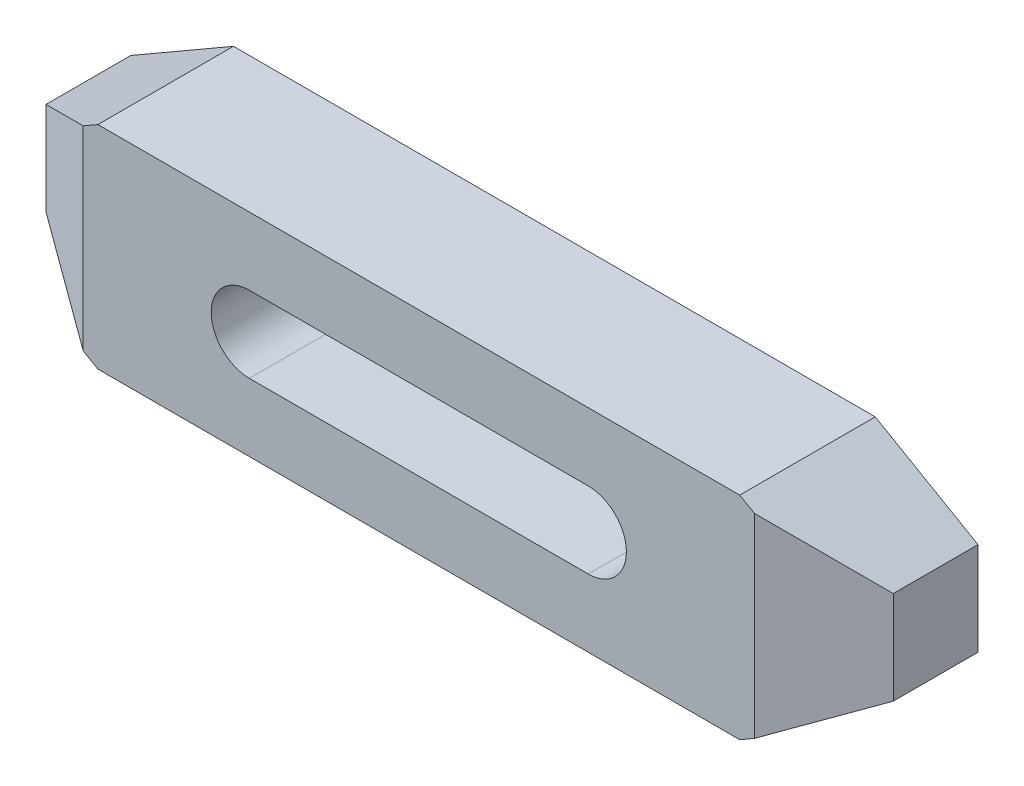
ISO-10303-21;
HEADER;
FILE_DESCRIPTION(('STEP AP214'),'2;1');
FILE_NAME('part.step','',(''),(''),'','','');
FILE_SCHEMA(('AUTOMOTIVE_DESIGN { 1 0 10303 214 1 1 1 1 }'));
ENDSEC;
DATA;
#1=APPLICATION_CONTEXT('core data for automotive mechanical design processes');
#2=APPLICATION_PROTOCOL_DEFINITION('international standard','automotive_design',2000,#1);
#3=PRODUCT_CONTEXT('',#1,'mechanical');
#4=PRODUCT('Part','Part','',(#3));
#5=PRODUCT_RELATED_PRODUCT_CATEGORY('part','',(#4));
#6=PRODUCT_DEFINITION_FORMATION('','',#4);
#7=PRODUCT_DEFINITION_CONTEXT('part definition',#1,'design');
#8=PRODUCT_DEFINITION('design','',#6,#7);
#9=PRODUCT_DEFINITION_SHAPE('','',#8);
#10=(LENGTH_UNIT() NAMED_UNIT(*) SI_UNIT(.MILLI.,.METRE.));
#11=(NAMED_UNIT(*) PLANE_ANGLE_UNIT() SI_UNIT($,.RADIAN.));
#12=(NAMED_UNIT(*) SI_UNIT($,.STERADIAN.) SOLID_ANGLE_UNIT());
#13=UNCERTAINTY_MEASURE_WITH_UNIT(LENGTH_MEASURE(1.E-05),#10,'distance_accuracy_value','');
#14=(GEOMETRIC_REPRESENTATION_CONTEXT(3) GLOBAL_UNCERTAINTY_ASSIGNED_CONTEXT((#13)) GLOBAL_UNIT_ASSIGNED_CONTEXT((#10,
#11,#12)) REPRESENTATION_CONTEXT('',''));
#15=CARTESIAN_POINT('',(0.,0.,0.));
#16=DIRECTION('',(0.,0.,1.));
#17=DIRECTION('',(1.,0.,0.));
#18=AXIS2_PLACEMENT_3D('',#15,#16,#17);
#19=CARTESIAN_POINT('',(0.,-34.3675134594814,16.));
#20=DIRECTION('',(0.,0.,-1.));
#21=DIRECTION('',(-1.,0.,0.));
#22=AXIS2_PLACEMENT_3D('',#19,#20,#21);
#23=PLANE('',#22);
#24=CARTESIAN_POINT('',(20.,0.,16.));
#25=DIRECTION('',(0.,0.,1.));
#26=DIRECTION('',(1.,0.,0.));
#27=AXIS2_PLACEMENT_3D('',#24,#25,#26);
#28=CIRCLE('',#27,4.5);
#29=CARTESIAN_POINT('',(20.,-4.5,16.));
#30=VERTEX_POINT('',#29);
#31=CARTESIAN_POINT('',(20.,4.5,16.));
#32=VERTEX_POINT('',#31);
#33=EDGE_CURVE('E221',#30,#32,#28,.T.);
#34=ORIENTED_EDGE('',*,*,#33,.F.);
#35=DIRECTION('',(-1.,0.,0.));
#36=VECTOR('',#35,1.);
#37=CARTESIAN_POINT('',(20.,-4.5,16.));
#38=LINE('',#37,#36);
#39=CARTESIAN_POINT('',(-20.,-4.5,16.));
#40=VERTEX_POINT('',#39);
#41=EDGE_CURVE('E220',#30,#40,#38,.T.);
#42=ORIENTED_EDGE('',*,*,#41,.T.);
#43=CARTESIAN_POINT('',(-20.,0.,16.));
#44=DIRECTION('',(0.,0.,1.));
#45=DIRECTION('',(1.,0.,0.));
#46=AXIS2_PLACEMENT_3D('',#43,#44,#45);
#47=CIRCLE('',#46,4.5);
#48=CARTESIAN_POINT('',(-20.,4.5,16.));
#49=VERTEX_POINT('',#48);
#50=EDGE_CURVE('E228',#49,#40,#47,.T.);
#51=ORIENTED_EDGE('',*,*,#50,.F.);
#52=DIRECTION('',(-1.,0.,0.));
#53=VECTOR('',#52,1.);
#54=CARTESIAN_POINT('',(20.,4.5,16.));
#55=LINE('',#54,#53);
#56=EDGE_CURVE('E224',#32,#49,#55,.T.);
#57=ORIENTED_EDGE('',*,*,#56,.F.);
#58=EDGE_LOOP('',(#34,#42,#51,#57));
#59=FACE_BOUND('',#58,.T.);
#60=DIRECTION('',(0.,1.,0.));
#61=VECTOR('',#60,1.);
#62=CARTESIAN_POINT('',(-39.6076951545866,-34.3675134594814,16.));
#63=LINE('',#62,#61);
#64=CARTESIAN_POINT('',(-39.6076951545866,-11.5,16.));
#65=VERTEX_POINT('',#64);
#66=CARTESIAN_POINT('',(-39.6076951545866,11.5,16.));
#67=VERTEX_POINT('',#66);
#68=EDGE_CURVE('E115',#65,#67,#63,.T.);
#69=ORIENTED_EDGE('',*,*,#68,.F.);
#70=DIRECTION('',(-0.866025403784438,0.5,0.));
#71=VECTOR('',#70,1.);
#72=CARTESIAN_POINT('',(-37.8756443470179,-12.5,16.));
#73=LINE('',#72,#71);
#74=CARTESIAN_POINT('',(-37.8756443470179,-12.5,16.));
#75=VERTEX_POINT('',#74);
#76=EDGE_CURVE('E174',#75,#65,#73,.T.);
#77=ORIENTED_EDGE('',*,*,#76,.F.);
#78=DIRECTION('',(-1.,0.,0.));
#79=VECTOR('',#78,1.);
#80=CARTESIAN_POINT('',(37.8756443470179,-12.5,16.));
#81=LINE('',#80,#79);
#82=CARTESIAN_POINT('',(37.8756443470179,-12.5,16.));
#83=VERTEX_POINT('',#82);
#84=EDGE_CURVE('E177',#83,#75,#81,.T.);
#85=ORIENTED_EDGE('',*,*,#84,.F.);
#86=DIRECTION('',(-0.866025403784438,-0.5,0.));
#87=VECTOR('',#86,1.);
#88=CARTESIAN_POINT('',(50.,-5.5,16.));
#89=LINE('',#88,#87);
#90=CARTESIAN_POINT('',(39.6076951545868,-11.5,16.));
#91=VERTEX_POINT('',#90);
#92=EDGE_CURVE('E157',#91,#83,#89,.T.);
#93=ORIENTED_EDGE('',*,*,#92,.F.);
#94=DIRECTION('',(0.,1.,0.));
#95=VECTOR('',#94,1.);
#96=CARTESIAN_POINT('',(39.6076951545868,-34.3675134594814,16.));
#97=LINE('',#96,#95);
#98=CARTESIAN_POINT('',(39.6076951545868,11.5,16.));
#99=VERTEX_POINT('',#98);
#100=EDGE_CURVE('E146',#91,#99,#97,.T.);
#101=ORIENTED_EDGE('',*,*,#100,.T.);
#102=DIRECTION('',(0.866025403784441,-0.5,0.));
#103=VECTOR('',#102,1.);
#104=CARTESIAN_POINT('',(37.8756443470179,12.5,16.));
#105=LINE('',#104,#103);
#106=CARTESIAN_POINT('',(37.8756443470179,12.5,16.));
#107=VERTEX_POINT('',#106);
#108=EDGE_CURVE('E155',#107,#99,#105,.T.);
#109=ORIENTED_EDGE('',*,*,#108,.F.);
#110=DIRECTION('',(1.,0.,0.));
#111=VECTOR('',#110,1.);
#112=CARTESIAN_POINT('',(-37.8756443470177,12.5,16.));
#113=LINE('',#112,#111);
#114=CARTESIAN_POINT('',(-37.8756443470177,12.5,16.));
#115=VERTEX_POINT('',#114);
#116=EDGE_CURVE('E164',#115,#107,#113,.T.);
#117=ORIENTED_EDGE('',*,*,#116,.F.);
#118=DIRECTION('',(0.866025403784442,0.5,0.));
#119=VECTOR('',#118,1.);
#120=CARTESIAN_POINT('',(-50.,5.5,16.));
#121=LINE('',#120,#119);
#122=EDGE_CURVE('E167',#67,#115,#121,.T.);
#123=ORIENTED_EDGE('',*,*,#122,.F.);
#124=EDGE_LOOP('',(#69,#77,#85,#93,#101,#109,#117,#123));
#125=FACE_BOUND('',#124,.T.);
#126=ADVANCED_FACE('F14',(#59,#125),#23,.F.);
#127=CARTESIAN_POINT('',(-50.,5.5,16.));
#128=DIRECTION('',(-0.5,0.866025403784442,0.));
#129=DIRECTION('',(-0.866025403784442,-0.5,0.));
#130=AXIS2_PLACEMENT_3D('',#127,#128,#129);
#131=PLANE('',#130);
#132=DIRECTION('',(0.,0.,-1.));
#133=VECTOR('',#132,1.);
#134=CARTESIAN_POINT('',(-50.,5.5,16.));
#135=LINE('',#134,#133);
#136=CARTESIAN_POINT('',(-50.,5.5,10.));
#137=VERTEX_POINT('',#136);
#138=CARTESIAN_POINT('',(-50.,5.5,0.));
#139=VERTEX_POINT('',#138);
#140=EDGE_CURVE('E124',#137,#139,#135,.T.);
#141=ORIENTED_EDGE('',*,*,#140,.F.);
#142=DIRECTION('',(0.774596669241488,0.447213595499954,0.447213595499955));
#143=VECTOR('',#142,1.);
#144=CARTESIAN_POINT('',(-47.9215390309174,6.7,11.2));
#145=LINE('',#144,#143);
#146=EDGE_CURVE('E112',#137,#67,#145,.T.);
#147=ORIENTED_EDGE('',*,*,#146,.T.);
#148=ORIENTED_EDGE('',*,*,#122,.T.);
#149=DIRECTION('',(0.,0.,-1.));
#150=VECTOR('',#149,1.);
#151=CARTESIAN_POINT('',(-37.8756443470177,12.5,16.));
#152=LINE('',#151,#150);
#153=CARTESIAN_POINT('',(-37.8756443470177,12.5,0.));
#154=VERTEX_POINT('',#153);
#155=EDGE_CURVE('E132',#115,#154,#152,.T.);
#156=ORIENTED_EDGE('',*,*,#155,.T.);
#157=DIRECTION('',(0.866025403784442,0.5,0.));
#158=VECTOR('',#157,1.);
#159=CARTESIAN_POINT('',(-50.,5.5,0.));
#160=LINE('',#159,#158);
#161=EDGE_CURVE('E131',#139,#154,#160,.T.);
#162=ORIENTED_EDGE('',*,*,#161,.F.);
#163=EDGE_LOOP('',(#141,#147,#148,#156,#162));
#164=FACE_BOUND('',#163,.T.);
#165=ADVANCED_FACE('F129',(#164),#131,.T.);
#166=CARTESIAN_POINT('',(-50.,-5.5,16.));
#167=DIRECTION('',(-1.,0.,0.));
#168=DIRECTION('',(0.,0.,1.));
#169=AXIS2_PLACEMENT_3D('',#166,#167,#168);
#170=PLANE('',#169);
#171=DIRECTION('',(0.,0.,-1.));
#172=VECTOR('',#171,1.);
#173=CARTESIAN_POINT('',(-50.,-5.5,16.));
#174=LINE('',#173,#172);
#175=CARTESIAN_POINT('',(-50.,-5.5,10.));
#176=VERTEX_POINT('',#175);
#177=CARTESIAN_POINT('',(-50.,-5.5,0.));
#178=VERTEX_POINT('',#177);
#179=EDGE_CURVE('E126',#176,#178,#174,.T.);
#180=ORIENTED_EDGE('',*,*,#179,.F.);
#181=DIRECTION('',(0.,1.,0.));
#182=VECTOR('',#181,1.);
#183=CARTESIAN_POINT('',(-50.,-13.,10.));
#184=LINE('',#183,#182);
#185=EDGE_CURVE('E29',#176,#137,#184,.T.);
#186=ORIENTED_EDGE('',*,*,#185,.T.);
#187=ORIENTED_EDGE('',*,*,#140,.T.);
#188=DIRECTION('',(0.,1.,0.));
#189=VECTOR('',#188,1.);
#190=CARTESIAN_POINT('',(-50.,-5.5,0.));
#191=LINE('',#190,#189);
#192=EDGE_CURVE('E199',#178,#139,#191,.T.);
#193=ORIENTED_EDGE('',*,*,#192,.F.);
#194=EDGE_LOOP('',(#180,#186,#187,#193));
#195=FACE_BOUND('',#194,.T.);
#196=ADVANCED_FACE('F122',(#195),#170,.T.);
#197=CARTESIAN_POINT('',(-37.8756443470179,-12.5,16.));
#198=DIRECTION('',(-0.5,-0.866025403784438,0.));
#199=DIRECTION('',(0.866025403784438,-0.5,0.));
#200=AXIS2_PLACEMENT_3D('',#197,#198,#199);
#201=PLANE('',#200);
#202=ORIENTED_EDGE('',*,*,#76,.T.);
#203=DIRECTION('',(-0.774596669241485,0.447213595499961,-0.447213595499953));
#204=VECTOR('',#203,1.);
#205=CARTESIAN_POINT('',(-38.2220545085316,-12.3,16.8));
#206=LINE('',#205,#204);
#207=EDGE_CURVE('E9',#65,#176,#206,.T.);
#208=ORIENTED_EDGE('',*,*,#207,.T.);
#209=ORIENTED_EDGE('',*,*,#179,.T.);
#210=DIRECTION('',(-0.866025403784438,0.5,0.));
#211=VECTOR('',#210,1.);
#212=CARTESIAN_POINT('',(-37.8756443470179,-12.5,0.));
#213=LINE('',#212,#211);
#214=CARTESIAN_POINT('',(-37.8756443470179,-12.5,0.));
#215=VERTEX_POINT('',#214);
#216=EDGE_CURVE('E195',#215,#178,#213,.T.);
#217=ORIENTED_EDGE('',*,*,#216,.F.);
#218=DIRECTION('',(0.,0.,-1.));
#219=VECTOR('',#218,1.);
#220=CARTESIAN_POINT('',(-37.8756443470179,-12.5,16.));
#221=LINE('',#220,#219);
#222=EDGE_CURVE('E136',#75,#215,#221,.T.);
#223=ORIENTED_EDGE('',*,*,#222,.F.);
#224=EDGE_LOOP('',(#202,#208,#209,#217,#223));
#225=FACE_BOUND('',#224,.T.);
#226=ADVANCED_FACE('F198',(#225),#201,.T.);
#227=CARTESIAN_POINT('',(0.,-34.3675134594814,0.));
#228=DIRECTION('',(0.,0.,-1.));
#229=DIRECTION('',(-1.,0.,0.));
#230=AXIS2_PLACEMENT_3D('',#227,#228,#229);
#231=PLANE('',#230);
#232=DIRECTION('',(-0.866025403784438,-0.5,0.));
#233=VECTOR('',#232,1.);
#234=CARTESIAN_POINT('',(50.,-5.5,0.));
#235=LINE('',#234,#233);
#236=CARTESIAN_POINT('',(50.,-5.5,0.));
#237=VERTEX_POINT('',#236);
#238=CARTESIAN_POINT('',(37.8756443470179,-12.5,0.));
#239=VERTEX_POINT('',#238);
#240=EDGE_CURVE('E170',#237,#239,#235,.T.);
#241=ORIENTED_EDGE('',*,*,#240,.T.);
#242=DIRECTION('',(-1.,0.,0.));
#243=VECTOR('',#242,1.);
#244=CARTESIAN_POINT('',(37.8756443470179,-12.5,0.));
#245=LINE('',#244,#243);
#246=EDGE_CURVE('E186',#239,#215,#245,.T.);
#247=ORIENTED_EDGE('',*,*,#246,.T.);
#248=ORIENTED_EDGE('',*,*,#216,.T.);
#249=ORIENTED_EDGE('',*,*,#192,.T.);
#250=ORIENTED_EDGE('',*,*,#161,.T.);
#251=DIRECTION('',(1.,0.,0.));
#252=VECTOR('',#251,1.);
#253=CARTESIAN_POINT('',(-37.8756443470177,12.5,0.));
#254=LINE('',#253,#252);
#255=CARTESIAN_POINT('',(37.8756443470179,12.5,0.));
#256=VERTEX_POINT('',#255);
#257=EDGE_CURVE('E204',#154,#256,#254,.T.);
#258=ORIENTED_EDGE('',*,*,#257,.T.);
#259=DIRECTION('',(0.866025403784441,-0.5,0.));
#260=VECTOR('',#259,1.);
#261=CARTESIAN_POINT('',(37.8756443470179,12.5,0.));
#262=LINE('',#261,#260);
#263=CARTESIAN_POINT('',(50.,5.50000000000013,0.));
#264=VERTEX_POINT('',#263);
#265=EDGE_CURVE('E207',#256,#264,#262,.T.);
#266=ORIENTED_EDGE('',*,*,#265,.T.);
#267=DIRECTION('',(0.,-1.,0.));
#268=VECTOR('',#267,1.);
#269=CARTESIAN_POINT('',(50.,5.50000000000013,0.));
#270=LINE('',#269,#268);
#271=EDGE_CURVE('E180',#264,#237,#270,.T.);
#272=ORIENTED_EDGE('',*,*,#271,.T.);
#273=EDGE_LOOP('',(#241,#247,#248,#249,#250,#258,#266,#272));
#274=FACE_BOUND('',#273,.T.);
#275=DIRECTION('',(-1.,0.,0.));
#276=VECTOR('',#275,1.);
#277=CARTESIAN_POINT('',(20.,-4.5,0.));
#278=LINE('',#277,#276);
#279=CARTESIAN_POINT('',(20.,-4.5,0.));
#280=VERTEX_POINT('',#279);
#281=CARTESIAN_POINT('',(-20.,-4.5,0.));
#282=VERTEX_POINT('',#281);
#283=EDGE_CURVE('E225',#280,#282,#278,.T.);
#284=ORIENTED_EDGE('',*,*,#283,.F.);
#285=CARTESIAN_POINT('',(20.,0.,0.));
#286=DIRECTION('',(0.,0.,1.));
#287=DIRECTION('',(1.,0.,0.));
#288=AXIS2_PLACEMENT_3D('',#285,#286,#287);
#289=CIRCLE('',#288,4.5);
#290=CARTESIAN_POINT('',(20.,4.5,0.));
#291=VERTEX_POINT('',#290);
#292=EDGE_CURVE('E232',#280,#291,#289,.T.);
#293=ORIENTED_EDGE('',*,*,#292,.T.);
#294=DIRECTION('',(-1.,0.,0.));
#295=VECTOR('',#294,1.);
#296=CARTESIAN_POINT('',(20.,4.5,0.));
#297=LINE('',#296,#295);
#298=CARTESIAN_POINT('',(-20.,4.5,0.));
#299=VERTEX_POINT('',#298);
#300=EDGE_CURVE('E235',#291,#299,#297,.T.);
#301=ORIENTED_EDGE('',*,*,#300,.T.);
#302=CARTESIAN_POINT('',(-20.,0.,0.));
#303=DIRECTION('',(0.,0.,1.));
#304=DIRECTION('',(1.,0.,0.));
#305=AXIS2_PLACEMENT_3D('',#302,#303,#304);
#306=CIRCLE('',#305,4.5);
#307=EDGE_CURVE('E238',#299,#282,#306,.T.);
#308=ORIENTED_EDGE('',*,*,#307,.T.);
#309=EDGE_LOOP('',(#284,#293,#301,#308));
#310=FACE_BOUND('',#309,.T.);
#311=ADVANCED_FACE('F193',(#274,#310),#231,.T.);
#312=CARTESIAN_POINT('',(50.,-5.5,16.));
#313=DIRECTION('',(0.5,-0.866025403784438,0.));
#314=DIRECTION('',(0.866025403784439,0.5,0.));
#315=AXIS2_PLACEMENT_3D('',#312,#313,#314);
#316=PLANE('',#315);
#317=DIRECTION('',(0.774596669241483,0.447213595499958,-0.447213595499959));
#318=VECTOR('',#317,1.);
#319=CARTESIAN_POINT('',(47.9215390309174,-6.7,11.2));
#320=LINE('',#319,#318);
#321=CARTESIAN_POINT('',(50.,-5.5,10.));
#322=VERTEX_POINT('',#321);
#323=EDGE_CURVE('E158',#91,#322,#320,.T.);
#324=ORIENTED_EDGE('',*,*,#323,.F.);
#325=ORIENTED_EDGE('',*,*,#92,.T.);
#326=DIRECTION('',(0.,0.,-1.));
#327=VECTOR('',#326,1.);
#328=CARTESIAN_POINT('',(37.8756443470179,-12.5,16.));
#329=LINE('',#328,#327);
#330=EDGE_CURVE('E163',#83,#239,#329,.T.);
#331=ORIENTED_EDGE('',*,*,#330,.T.);
#332=ORIENTED_EDGE('',*,*,#240,.F.);
#333=DIRECTION('',(0.,0.,-1.));
#334=VECTOR('',#333,1.);
#335=CARTESIAN_POINT('',(50.,-5.5,16.));
#336=LINE('',#335,#334);
#337=EDGE_CURVE('E143',#322,#237,#336,.T.);
#338=ORIENTED_EDGE('',*,*,#337,.F.);
#339=EDGE_LOOP('',(#324,#325,#331,#332,#338));
#340=FACE_BOUND('',#339,.T.);
#341=ADVANCED_FACE('F249',(#340),#316,.T.);
#342=CARTESIAN_POINT('',(50.,5.50000000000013,16.));
#343=DIRECTION('',(1.,0.,0.));
#344=DIRECTION('',(0.,0.,-1.));
#345=AXIS2_PLACEMENT_3D('',#342,#343,#344);
#346=PLANE('',#345);
#347=DIRECTION('',(0.,1.,0.));
#348=VECTOR('',#347,1.);
#349=CARTESIAN_POINT('',(50.,-13.,10.));
#350=LINE('',#349,#348);
#351=CARTESIAN_POINT('',(50.,5.50000000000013,10.));
#352=VERTEX_POINT('',#351);
#353=EDGE_CURVE('E36',#322,#352,#350,.T.);
#354=ORIENTED_EDGE('',*,*,#353,.F.);
#355=ORIENTED_EDGE('',*,*,#337,.T.);
#356=ORIENTED_EDGE('',*,*,#271,.F.);
#357=DIRECTION('',(0.,0.,-1.));
#358=VECTOR('',#357,1.);
#359=CARTESIAN_POINT('',(50.,5.50000000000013,16.));
#360=LINE('',#359,#358);
#361=EDGE_CURVE('E141',#352,#264,#360,.T.);
#362=ORIENTED_EDGE('',*,*,#361,.F.);
#363=EDGE_LOOP('',(#354,#355,#356,#362));
#364=FACE_BOUND('',#363,.T.);
#365=ADVANCED_FACE('F16',(#364),#346,.T.);
#366=CARTESIAN_POINT('',(37.8756443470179,12.5,16.));
#367=DIRECTION('',(0.5,0.866025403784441,0.));
#368=DIRECTION('',(-0.866025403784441,0.5,0.));
#369=AXIS2_PLACEMENT_3D('',#366,#367,#368);
#370=PLANE('',#369);
#371=DIRECTION('',(-0.774596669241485,0.447213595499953,0.44721359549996));
#372=VECTOR('',#371,1.);
#373=CARTESIAN_POINT('',(38.2220545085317,12.3,16.8));
#374=LINE('',#373,#372);
#375=EDGE_CURVE('E22',#352,#99,#374,.T.);
#376=ORIENTED_EDGE('',*,*,#375,.F.);
#377=ORIENTED_EDGE('',*,*,#361,.T.);
#378=ORIENTED_EDGE('',*,*,#265,.F.);
#379=DIRECTION('',(0.,0.,-1.));
#380=VECTOR('',#379,1.);
#381=CARTESIAN_POINT('',(37.8756443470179,12.5,16.));
#382=LINE('',#381,#380);
#383=EDGE_CURVE('E134',#107,#256,#382,.T.);
#384=ORIENTED_EDGE('',*,*,#383,.F.);
#385=ORIENTED_EDGE('',*,*,#108,.T.);
#386=EDGE_LOOP('',(#376,#377,#378,#384,#385));
#387=FACE_BOUND('',#386,.T.);
#388=ADVANCED_FACE('F160',(#387),#370,.T.);
#389=CARTESIAN_POINT('',(-37.8756443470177,12.5,16.));
#390=DIRECTION('',(0.,1.,0.));
#391=DIRECTION('',(-1.,0.,0.));
#392=AXIS2_PLACEMENT_3D('',#389,#390,#391);
#393=PLANE('',#392);
#394=ORIENTED_EDGE('',*,*,#155,.F.);
#395=ORIENTED_EDGE('',*,*,#116,.T.);
#396=ORIENTED_EDGE('',*,*,#383,.T.);
#397=ORIENTED_EDGE('',*,*,#257,.F.);
#398=EDGE_LOOP('',(#394,#395,#396,#397));
#399=FACE_BOUND('',#398,.T.);
#400=ADVANCED_FACE('F253',(#399),#393,.T.);
#401=CARTESIAN_POINT('',(37.8756443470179,-12.5,16.));
#402=DIRECTION('',(0.,-1.,0.));
#403=DIRECTION('',(1.,0.,0.));
#404=AXIS2_PLACEMENT_3D('',#401,#402,#403);
#405=PLANE('',#404);
#406=ORIENTED_EDGE('',*,*,#84,.T.);
#407=ORIENTED_EDGE('',*,*,#222,.T.);
#408=ORIENTED_EDGE('',*,*,#246,.F.);
#409=ORIENTED_EDGE('',*,*,#330,.F.);
#410=EDGE_LOOP('',(#406,#407,#408,#409));
#411=FACE_BOUND('',#410,.T.);
#412=ADVANCED_FACE('F184',(#411),#405,.T.);
#413=CARTESIAN_POINT('',(20.,0.,16.));
#414=DIRECTION('',(0.,0.,-1.));
#415=DIRECTION('',(-1.,0.,0.));
#416=AXIS2_PLACEMENT_3D('',#413,#414,#415);
#417=CYLINDRICAL_SURFACE('',#416,4.5);
#418=DIRECTION('',(0.,0.,-1.));
#419=VECTOR('',#418,1.);
#420=CARTESIAN_POINT('',(20.,4.5,16.));
#421=LINE('',#420,#419);
#422=EDGE_CURVE('E211',#32,#291,#421,.T.);
#423=ORIENTED_EDGE('',*,*,#422,.T.);
#424=ORIENTED_EDGE('',*,*,#292,.F.);
#425=DIRECTION('',(0.,0.,-1.));
#426=VECTOR('',#425,1.);
#427=CARTESIAN_POINT('',(20.,-4.5,16.));
#428=LINE('',#427,#426);
#429=EDGE_CURVE('E217',#30,#280,#428,.T.);
#430=ORIENTED_EDGE('',*,*,#429,.F.);
#431=ORIENTED_EDGE('',*,*,#33,.T.);
#432=EDGE_LOOP('',(#423,#424,#430,#431));
#433=FACE_BOUND('',#432,.T.);
#434=ADVANCED_FACE('F261',(#433),#417,.F.);
#435=CARTESIAN_POINT('',(20.,4.5,16.));
#436=DIRECTION('',(0.,-1.,0.));
#437=DIRECTION('',(1.,0.,0.));
#438=AXIS2_PLACEMENT_3D('',#435,#436,#437);
#439=PLANE('',#438);
#440=DIRECTION('',(0.,0.,-1.));
#441=VECTOR('',#440,1.);
#442=CARTESIAN_POINT('',(-20.,4.5,16.));
#443=LINE('',#442,#441);
#444=EDGE_CURVE('E213',#49,#299,#443,.T.);
#445=ORIENTED_EDGE('',*,*,#444,.T.);
#446=ORIENTED_EDGE('',*,*,#300,.F.);
#447=ORIENTED_EDGE('',*,*,#422,.F.);
#448=ORIENTED_EDGE('',*,*,#56,.T.);
#449=EDGE_LOOP('',(#445,#446,#447,#448));
#450=FACE_BOUND('',#449,.T.);
#451=ADVANCED_FACE('F336',(#450),#439,.T.);
#452=CARTESIAN_POINT('',(-20.,0.,16.));
#453=DIRECTION('',(0.,0.,-1.));
#454=DIRECTION('',(-1.,0.,0.));
#455=AXIS2_PLACEMENT_3D('',#452,#453,#454);
#456=CYLINDRICAL_SURFACE('',#455,4.5);
#457=DIRECTION('',(0.,0.,-1.));
#458=VECTOR('',#457,1.);
#459=CARTESIAN_POINT('',(-20.,-4.5,16.));
#460=LINE('',#459,#458);
#461=EDGE_CURVE('E215',#40,#282,#460,.T.);
#462=ORIENTED_EDGE('',*,*,#461,.T.);
#463=ORIENTED_EDGE('',*,*,#307,.F.);
#464=ORIENTED_EDGE('',*,*,#444,.F.);
#465=ORIENTED_EDGE('',*,*,#50,.T.);
#466=EDGE_LOOP('',(#462,#463,#464,#465));
#467=FACE_BOUND('',#466,.T.);
#468=ADVANCED_FACE('F346',(#467),#456,.F.);
#469=CARTESIAN_POINT('',(20.,-4.5,16.));
#470=DIRECTION('',(0.,-1.,0.));
#471=DIRECTION('',(1.,0.,0.));
#472=AXIS2_PLACEMENT_3D('',#469,#470,#471);
#473=PLANE('',#472);
#474=ORIENTED_EDGE('',*,*,#41,.F.);
#475=ORIENTED_EDGE('',*,*,#429,.T.);
#476=ORIENTED_EDGE('',*,*,#283,.T.);
#477=ORIENTED_EDGE('',*,*,#461,.F.);
#478=EDGE_LOOP('',(#474,#475,#476,#477));
#479=FACE_BOUND('',#478,.T.);
#480=ADVANCED_FACE('F355',(#479),#473,.F.);
#481=CARTESIAN_POINT('',(50.,-13.,10.));
#482=DIRECTION('',(-0.5,0.,-0.866025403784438));
#483=DIRECTION('',(-0.866025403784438,0.,0.5));
#484=AXIS2_PLACEMENT_3D('',#481,#482,#483);
#485=PLANE('',#484);
#486=ORIENTED_EDGE('',*,*,#323,.T.);
#487=ORIENTED_EDGE('',*,*,#353,.T.);
#488=ORIENTED_EDGE('',*,*,#375,.T.);
#489=ORIENTED_EDGE('',*,*,#100,.F.);
#490=EDGE_LOOP('',(#486,#487,#488,#489));
#491=FACE_BOUND('',#490,.T.);
#492=ADVANCED_FACE('F145',(#491),#485,.F.);
#493=CARTESIAN_POINT('',(-50.,-13.,10.));
#494=DIRECTION('',(-0.5,0.,0.866025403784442));
#495=DIRECTION('',(0.866025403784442,0.,0.5));
#496=AXIS2_PLACEMENT_3D('',#493,#494,#495);
#497=PLANE('',#496);
#498=ORIENTED_EDGE('',*,*,#185,.F.);
#499=ORIENTED_EDGE('',*,*,#207,.F.);
#500=ORIENTED_EDGE('',*,*,#68,.T.);
#501=ORIENTED_EDGE('',*,*,#146,.F.);
#502=EDGE_LOOP('',(#498,#499,#500,#501));
#503=FACE_BOUND('',#502,.T.);
#504=ADVANCED_FACE('F113',(#503),#497,.T.);
#505=CLOSED_SHELL('',(#126,#165,#196,#226,#311,#341,#365,#388,#400,#412,#434,#451,#468,#480,
#492,#504));
#506=MANIFOLD_SOLID_BREP('B1',#505);
#507=ADVANCED_BREP_SHAPE_REPRESENTATION('',(#18,#506),#14);
#508=SHAPE_DEFINITION_REPRESENTATION(#9,#507);
ENDSEC;
END-ISO-10303-21;
